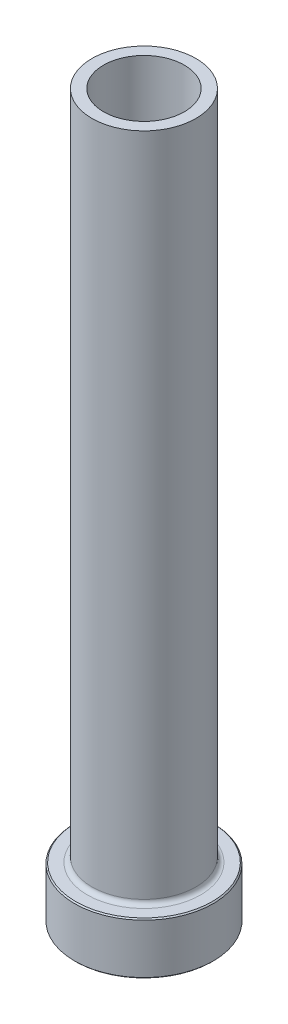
from build123d import *

# Parameters (mm, degrees)
FILLET1_R     = 0.8
CHAMFER1_SIZE = 0.2
CHAMFER3_SIZE = 0.5


with BuildPart() as part:
    # Sketch1 → Revolve1 (revolve)
    with BuildSketch(Plane.XY, mode=Mode.PRIVATE) as revolve1_sk:
        Polygon((-7, 125), (-9, 125), (-9, 9), (-12, 9), (-12, 0), (-7.25, 0), (-7.25, 58), (-7, 70), align=None)
    revolve(revolve1_sk.sketch.rotate(Axis((0, 92.187680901, 0), (0, -1, 0)), 270), axis=Axis((0, 92.187680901, 0), (0, -1, 0)))

    # Fillet1
    fillet1_edges = [part.edges().sort_by_distance(p)[0] for p in [
        (0, 9, -9),
    ]]
    fillet(fillet1_edges, radius=FILLET1_R)

    # Chamfer1
    chamfer1_edges = [part.edges().sort_by_distance(p)[0] for p in [
        (0, 0, -12),
        (0, 9, -12),
    ]]
    chamfer(chamfer1_edges, length=CHAMFER1_SIZE)

    # Chamfer3
    chamfer3_edges = [part.edges().sort_by_distance(p)[0] for p in [
        (0, 0, -7.25),
    ]]
    chamfer(chamfer3_edges, length=CHAMFER3_SIZE)


solid = part.part
